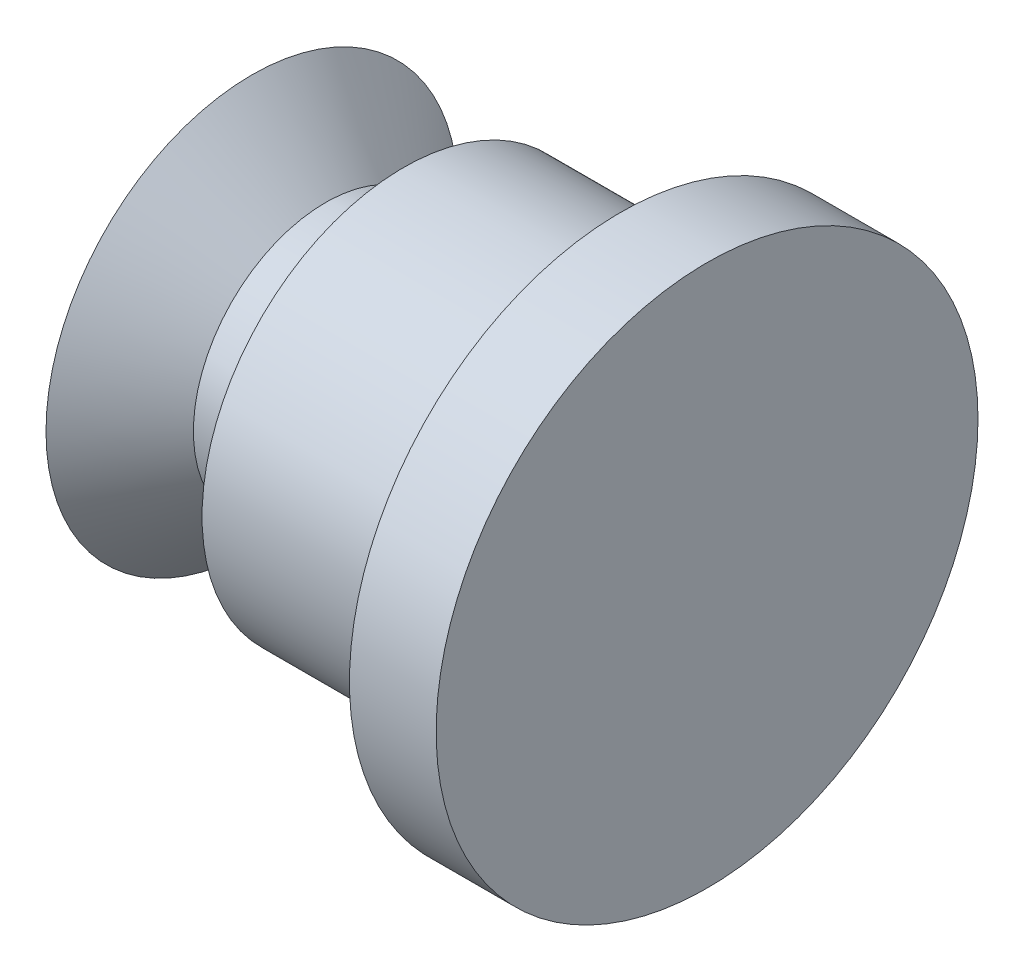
ISO-10303-21;
HEADER;
FILE_DESCRIPTION(('STEP AP214'),'2;1');
FILE_NAME('part.step','',(''),(''),'','','');
FILE_SCHEMA(('AUTOMOTIVE_DESIGN { 1 0 10303 214 1 1 1 1 }'));
ENDSEC;
DATA;
#1=APPLICATION_CONTEXT('core data for automotive mechanical design processes');
#2=APPLICATION_PROTOCOL_DEFINITION('international standard','automotive_design',2000,#1);
#3=PRODUCT_CONTEXT('',#1,'mechanical');
#4=PRODUCT('Part','Part','',(#3));
#5=PRODUCT_RELATED_PRODUCT_CATEGORY('part','',(#4));
#6=PRODUCT_DEFINITION_FORMATION('','',#4);
#7=PRODUCT_DEFINITION_CONTEXT('part definition',#1,'design');
#8=PRODUCT_DEFINITION('design','',#6,#7);
#9=PRODUCT_DEFINITION_SHAPE('','',#8);
#10=(LENGTH_UNIT() NAMED_UNIT(*) SI_UNIT(.MILLI.,.METRE.));
#11=(NAMED_UNIT(*) PLANE_ANGLE_UNIT() SI_UNIT($,.RADIAN.));
#12=(NAMED_UNIT(*) SI_UNIT($,.STERADIAN.) SOLID_ANGLE_UNIT());
#13=UNCERTAINTY_MEASURE_WITH_UNIT(LENGTH_MEASURE(1.E-05),#10,'distance_accuracy_value','');
#14=(GEOMETRIC_REPRESENTATION_CONTEXT(3) GLOBAL_UNCERTAINTY_ASSIGNED_CONTEXT((#13)) GLOBAL_UNIT_ASSIGNED_CONTEXT((#10,
#11,#12)) REPRESENTATION_CONTEXT('',''));
#15=CARTESIAN_POINT('',(0.,0.,0.));
#16=DIRECTION('',(0.,0.,1.));
#17=DIRECTION('',(1.,0.,0.));
#18=AXIS2_PLACEMENT_3D('',#15,#16,#17);
#19=CARTESIAN_POINT('',(0.,0.,0.));
#20=DIRECTION('',(1.,0.,0.));
#21=DIRECTION('',(0.,0.,-1.));
#22=AXIS2_PLACEMENT_3D('',#19,#20,#21);
#23=PLANE('',#22);
#24=CARTESIAN_POINT('',(0.,0.,0.));
#25=DIRECTION('',(1.,0.,0.));
#26=DIRECTION('',(0.,0.,-1.));
#27=AXIS2_PLACEMENT_3D('',#24,#25,#26);
#28=CIRCLE('',#27,3.175);
#29=CARTESIAN_POINT('',(0.,0.,-3.175));
#30=VERTEX_POINT('',#29);
#31=EDGE_CURVE('E10',#30,#30,#28,.T.);
#32=ORIENTED_EDGE('',*,*,#31,.T.);
#33=EDGE_LOOP('',(#32));
#34=FACE_BOUND('',#33,.T.);
#35=ADVANCED_FACE('F33',(#34),#23,.T.);
#36=CARTESIAN_POINT('',(0.,0.,0.));
#37=DIRECTION('',(1.,0.,0.));
#38=DIRECTION('',(0.,0.,-1.));
#39=AXIS2_PLACEMENT_3D('',#36,#37,#38);
#40=CYLINDRICAL_SURFACE('',#39,3.175);
#41=CARTESIAN_POINT('',(-1.016,0.,0.));
#42=DIRECTION('',(1.,0.,0.));
#43=DIRECTION('',(0.,0.,-1.));
#44=AXIS2_PLACEMENT_3D('',#41,#42,#43);
#45=CIRCLE('',#44,3.175);
#46=CARTESIAN_POINT('',(-1.016,0.,-3.175));
#47=VERTEX_POINT('',#46);
#48=EDGE_CURVE('E39',#47,#47,#45,.T.);
#49=ORIENTED_EDGE('',*,*,#48,.T.);
#50=EDGE_LOOP('',(#49));
#51=FACE_BOUND('',#50,.T.);
#52=ORIENTED_EDGE('',*,*,#31,.F.);
#53=EDGE_LOOP('',(#52));
#54=FACE_BOUND('',#53,.T.);
#55=ADVANCED_FACE('F74',(#51,#54),#40,.T.);
#56=CARTESIAN_POINT('',(-1.016,3.175,0.));
#57=DIRECTION('',(-1.,0.,0.));
#58=DIRECTION('',(0.,0.,1.));
#59=AXIS2_PLACEMENT_3D('',#56,#57,#58);
#60=PLANE('',#59);
#61=CARTESIAN_POINT('',(-1.016,0.,0.));
#62=DIRECTION('',(1.,0.,0.));
#63=DIRECTION('',(0.,0.,-1.));
#64=AXIS2_PLACEMENT_3D('',#61,#62,#63);
#65=CIRCLE('',#64,2.3622);
#66=CARTESIAN_POINT('',(-1.016,0.,-2.3622));
#67=VERTEX_POINT('',#66);
#68=EDGE_CURVE('E43',#67,#67,#65,.T.);
#69=ORIENTED_EDGE('',*,*,#68,.T.);
#70=EDGE_LOOP('',(#69));
#71=FACE_BOUND('',#70,.T.);
#72=ORIENTED_EDGE('',*,*,#48,.F.);
#73=EDGE_LOOP('',(#72));
#74=FACE_BOUND('',#73,.T.);
#75=ADVANCED_FACE('F78',(#71,#74),#60,.T.);
#76=CARTESIAN_POINT('',(0.,0.,0.));
#77=DIRECTION('',(1.,0.,0.));
#78=DIRECTION('',(0.,0.,-1.));
#79=AXIS2_PLACEMENT_3D('',#76,#77,#78);
#80=CYLINDRICAL_SURFACE('',#79,2.3622);
#81=CARTESIAN_POINT('',(-3.556,0.,0.));
#82=DIRECTION('',(1.,0.,0.));
#83=DIRECTION('',(0.,0.,-1.));
#84=AXIS2_PLACEMENT_3D('',#81,#82,#83);
#85=CIRCLE('',#84,2.3622);
#86=CARTESIAN_POINT('',(-3.556,0.,-2.3622));
#87=VERTEX_POINT('',#86);
#88=EDGE_CURVE('E47',#87,#87,#85,.T.);
#89=ORIENTED_EDGE('',*,*,#88,.T.);
#90=EDGE_LOOP('',(#89));
#91=FACE_BOUND('',#90,.T.);
#92=ORIENTED_EDGE('',*,*,#68,.F.);
#93=EDGE_LOOP('',(#92));
#94=FACE_BOUND('',#93,.T.);
#95=ADVANCED_FACE('F82',(#91,#94),#80,.T.);
#96=CARTESIAN_POINT('',(-3.556,2.3622,0.));
#97=DIRECTION('',(-1.,0.,0.));
#98=DIRECTION('',(0.,0.,1.));
#99=AXIS2_PLACEMENT_3D('',#96,#97,#98);
#100=PLANE('',#99);
#101=CARTESIAN_POINT('',(-3.556,0.,0.));
#102=DIRECTION('',(1.,0.,0.));
#103=DIRECTION('',(0.,0.,-1.));
#104=AXIS2_PLACEMENT_3D('',#101,#102,#103);
#105=CIRCLE('',#104,1.5494);
#106=CARTESIAN_POINT('',(-3.556,0.,-1.5494));
#107=VERTEX_POINT('',#106);
#108=EDGE_CURVE('E52',#107,#107,#105,.T.);
#109=ORIENTED_EDGE('',*,*,#108,.T.);
#110=EDGE_LOOP('',(#109));
#111=FACE_BOUND('',#110,.T.);
#112=ORIENTED_EDGE('',*,*,#88,.F.);
#113=EDGE_LOOP('',(#112));
#114=FACE_BOUND('',#113,.T.);
#115=ADVANCED_FACE('F89',(#111,#114),#100,.T.);
#116=CARTESIAN_POINT('',(0.,0.,0.));
#117=DIRECTION('',(1.,0.,0.));
#118=DIRECTION('',(0.,0.,-1.));
#119=AXIS2_PLACEMENT_3D('',#116,#117,#118);
#120=CYLINDRICAL_SURFACE('',#119,1.5494);
#121=CARTESIAN_POINT('',(-4.47039999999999,0.,0.));
#122=DIRECTION('',(1.,0.,0.));
#123=DIRECTION('',(0.,0.,-1.));
#124=AXIS2_PLACEMENT_3D('',#121,#122,#123);
#125=CIRCLE('',#124,1.5494);
#126=CARTESIAN_POINT('',(-4.47039999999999,0.,-1.5494));
#127=VERTEX_POINT('',#126);
#128=EDGE_CURVE('E55',#127,#127,#125,.T.);
#129=ORIENTED_EDGE('',*,*,#128,.T.);
#130=EDGE_LOOP('',(#129));
#131=FACE_BOUND('',#130,.T.);
#132=ORIENTED_EDGE('',*,*,#108,.F.);
#133=EDGE_LOOP('',(#132));
#134=FACE_BOUND('',#133,.T.);
#135=ADVANCED_FACE('F71',(#131,#134),#120,.T.);
#136=CARTESIAN_POINT('',(-4.47039999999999,0.,0.));
#137=DIRECTION('',(-1.,0.,0.));
#138=DIRECTION('',(0.,0.,1.));
#139=AXIS2_PLACEMENT_3D('',#136,#137,#138);
#140=CONICAL_SURFACE('',#139,1.5494,0.785398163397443);
#141=CARTESIAN_POINT('',(-5.334,0.,0.));
#142=DIRECTION('',(1.,0.,0.));
#143=DIRECTION('',(0.,0.,-1.));
#144=AXIS2_PLACEMENT_3D('',#141,#142,#143);
#145=CIRCLE('',#144,2.413);
#146=CARTESIAN_POINT('',(-5.334,0.,-2.413));
#147=VERTEX_POINT('',#146);
#148=EDGE_CURVE('E58',#147,#147,#145,.T.);
#149=ORIENTED_EDGE('',*,*,#148,.T.);
#150=EDGE_LOOP('',(#149));
#151=FACE_BOUND('',#150,.T.);
#152=ORIENTED_EDGE('',*,*,#128,.F.);
#153=EDGE_LOOP('',(#152));
#154=FACE_BOUND('',#153,.T.);
#155=ADVANCED_FACE('F62',(#151,#154),#140,.T.);
#156=CARTESIAN_POINT('',(-5.334,2.413,0.));
#157=DIRECTION('',(-1.,0.,0.));
#158=DIRECTION('',(0.,0.,1.));
#159=AXIS2_PLACEMENT_3D('',#156,#157,#158);
#160=PLANE('',#159);
#161=ORIENTED_EDGE('',*,*,#148,.F.);
#162=EDGE_LOOP('',(#161));
#163=FACE_BOUND('',#162,.T.);
#164=ADVANCED_FACE('F65',(#163),#160,.T.);
#165=CLOSED_SHELL('',(#35,#55,#75,#95,#115,#135,#155,#164));
#166=MANIFOLD_SOLID_BREP('B2',#165);
#167=ADVANCED_BREP_SHAPE_REPRESENTATION('',(#18,#166),#14);
#168=SHAPE_DEFINITION_REPRESENTATION(#9,#167);
ENDSEC;
END-ISO-10303-21;
